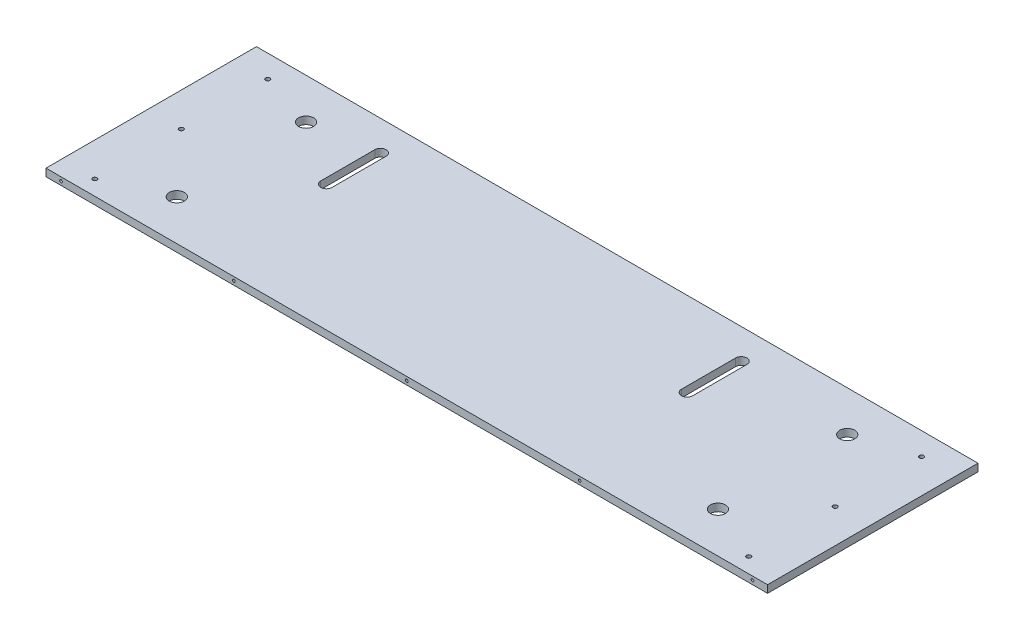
ISO-10303-21;
HEADER;
FILE_DESCRIPTION(('STEP AP214'),'2;1');
FILE_NAME('part.step','',(''),(''),'','','');
FILE_SCHEMA(('AUTOMOTIVE_DESIGN { 1 0 10303 214 1 1 1 1 }'));
ENDSEC;
DATA;
#1=APPLICATION_CONTEXT('core data for automotive mechanical design processes');
#2=APPLICATION_PROTOCOL_DEFINITION('international standard','automotive_design',2000,#1);
#3=PRODUCT_CONTEXT('',#1,'mechanical');
#4=PRODUCT('Part','Part','',(#3));
#5=PRODUCT_RELATED_PRODUCT_CATEGORY('part','',(#4));
#6=PRODUCT_DEFINITION_FORMATION('','',#4);
#7=PRODUCT_DEFINITION_CONTEXT('part definition',#1,'design');
#8=PRODUCT_DEFINITION('design','',#6,#7);
#9=PRODUCT_DEFINITION_SHAPE('','',#8);
#10=(LENGTH_UNIT() NAMED_UNIT(*) SI_UNIT(.MILLI.,.METRE.));
#11=(NAMED_UNIT(*) PLANE_ANGLE_UNIT() SI_UNIT($,.RADIAN.));
#12=(NAMED_UNIT(*) SI_UNIT($,.STERADIAN.) SOLID_ANGLE_UNIT());
#13=UNCERTAINTY_MEASURE_WITH_UNIT(LENGTH_MEASURE(1.E-05),#10,'distance_accuracy_value','');
#14=(GEOMETRIC_REPRESENTATION_CONTEXT(3) GLOBAL_UNCERTAINTY_ASSIGNED_CONTEXT((#13)) GLOBAL_UNIT_ASSIGNED_CONTEXT((#10,
#11,#12)) REPRESENTATION_CONTEXT('',''));
#15=CARTESIAN_POINT('',(0.,0.,0.));
#16=DIRECTION('',(0.,0.,1.));
#17=DIRECTION('',(1.,0.,0.));
#18=AXIS2_PLACEMENT_3D('',#15,#16,#17);
#19=CARTESIAN_POINT('',(304.8,6.35,-88.9));
#20=DIRECTION('',(-1.,0.,0.));
#21=DIRECTION('',(0.,0.,1.));
#22=AXIS2_PLACEMENT_3D('',#19,#20,#21);
#23=PLANE('',#22);
#24=DIRECTION('',(0.,0.,-1.));
#25=VECTOR('',#24,1.);
#26=CARTESIAN_POINT('',(304.8,0.,-88.9));
#27=LINE('',#26,#25);
#28=CARTESIAN_POINT('',(304.8,0.,88.9));
#29=VERTEX_POINT('',#28);
#30=CARTESIAN_POINT('',(304.8,0.,-88.9));
#31=VERTEX_POINT('',#30);
#32=EDGE_CURVE('E316',#29,#31,#27,.T.);
#33=ORIENTED_EDGE('',*,*,#32,.T.);
#34=DIRECTION('',(0.,-1.,0.));
#35=VECTOR('',#34,1.);
#36=CARTESIAN_POINT('',(304.8,6.35,-88.9));
#37=LINE('',#36,#35);
#38=CARTESIAN_POINT('',(304.8,6.35,-88.9));
#39=VERTEX_POINT('',#38);
#40=EDGE_CURVE('E11',#39,#31,#37,.T.);
#41=ORIENTED_EDGE('',*,*,#40,.F.);
#42=DIRECTION('',(0.,0.,-1.));
#43=VECTOR('',#42,1.);
#44=CARTESIAN_POINT('',(304.8,6.35,-88.9));
#45=LINE('',#44,#43);
#46=CARTESIAN_POINT('',(304.8,6.35,88.9));
#47=VERTEX_POINT('',#46);
#48=EDGE_CURVE('E317',#47,#39,#45,.T.);
#49=ORIENTED_EDGE('',*,*,#48,.F.);
#50=DIRECTION('',(0.,-1.,0.));
#51=VECTOR('',#50,1.);
#52=CARTESIAN_POINT('',(304.8,6.35,88.9));
#53=LINE('',#52,#51);
#54=EDGE_CURVE('E327',#47,#29,#53,.T.);
#55=ORIENTED_EDGE('',*,*,#54,.T.);
#56=EDGE_LOOP('',(#33,#41,#49,#55));
#57=FACE_BOUND('',#56,.T.);
#58=ADVANCED_FACE('F37',(#57),#23,.F.);
#59=CARTESIAN_POINT('',(-304.8,6.35,-88.9));
#60=DIRECTION('',(0.,0.,1.));
#61=DIRECTION('',(1.,0.,0.));
#62=AXIS2_PLACEMENT_3D('',#59,#60,#61);
#63=PLANE('',#62);
#64=DIRECTION('',(-1.,0.,0.));
#65=VECTOR('',#64,1.);
#66=CARTESIAN_POINT('',(-304.8,0.,-88.9));
#67=LINE('',#66,#65);
#68=CARTESIAN_POINT('',(-304.8,0.,-88.9));
#69=VERTEX_POINT('',#68);
#70=EDGE_CURVE('E330',#31,#69,#67,.T.);
#71=ORIENTED_EDGE('',*,*,#70,.T.);
#72=DIRECTION('',(0.,-1.,0.));
#73=VECTOR('',#72,1.);
#74=CARTESIAN_POINT('',(-304.8,6.35,-88.9));
#75=LINE('',#74,#73);
#76=CARTESIAN_POINT('',(-304.8,6.35,-88.9));
#77=VERTEX_POINT('',#76);
#78=EDGE_CURVE('E44',#77,#69,#75,.T.);
#79=ORIENTED_EDGE('',*,*,#78,.F.);
#80=DIRECTION('',(-1.,0.,0.));
#81=VECTOR('',#80,1.);
#82=CARTESIAN_POINT('',(-304.8,6.35,-88.9));
#83=LINE('',#82,#81);
#84=EDGE_CURVE('E320',#39,#77,#83,.T.);
#85=ORIENTED_EDGE('',*,*,#84,.F.);
#86=ORIENTED_EDGE('',*,*,#40,.T.);
#87=EDGE_LOOP('',(#71,#79,#85,#86));
#88=FACE_BOUND('',#87,.T.);
#89=ADVANCED_FACE('F359',(#88),#63,.F.);
#90=CARTESIAN_POINT('',(-304.8,6.35,-88.9));
#91=DIRECTION('',(1.,0.,0.));
#92=DIRECTION('',(0.,0.,-1.));
#93=AXIS2_PLACEMENT_3D('',#90,#91,#92);
#94=PLANE('',#93);
#95=DIRECTION('',(0.,0.,1.));
#96=VECTOR('',#95,1.);
#97=CARTESIAN_POINT('',(-304.8,0.,-88.9));
#98=LINE('',#97,#96);
#99=CARTESIAN_POINT('',(-304.8,0.,88.9));
#100=VERTEX_POINT('',#99);
#101=EDGE_CURVE('E332',#69,#100,#98,.T.);
#102=ORIENTED_EDGE('',*,*,#101,.T.);
#103=DIRECTION('',(0.,-1.,0.));
#104=VECTOR('',#103,1.);
#105=CARTESIAN_POINT('',(-304.8,6.35,88.9));
#106=LINE('',#105,#104);
#107=CARTESIAN_POINT('',(-304.8,6.35,88.9));
#108=VERTEX_POINT('',#107);
#109=EDGE_CURVE('E337',#108,#100,#106,.T.);
#110=ORIENTED_EDGE('',*,*,#109,.F.);
#111=DIRECTION('',(0.,0.,1.));
#112=VECTOR('',#111,1.);
#113=CARTESIAN_POINT('',(-304.8,6.35,-88.9));
#114=LINE('',#113,#112);
#115=EDGE_CURVE('E323',#77,#108,#114,.T.);
#116=ORIENTED_EDGE('',*,*,#115,.F.);
#117=ORIENTED_EDGE('',*,*,#78,.T.);
#118=EDGE_LOOP('',(#102,#110,#116,#117));
#119=FACE_BOUND('',#118,.T.);
#120=ADVANCED_FACE('F344',(#119),#94,.F.);
#121=CARTESIAN_POINT('',(-304.8,6.35,88.9));
#122=DIRECTION('',(0.,0.,-1.));
#123=DIRECTION('',(-1.,0.,0.));
#124=AXIS2_PLACEMENT_3D('',#121,#122,#123);
#125=PLANE('',#124);
#126=CARTESIAN_POINT('',(-292.1,3.17499999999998,88.9));
#127=DIRECTION('',(0.,0.,1.));
#128=DIRECTION('',(1.,0.,0.));
#129=AXIS2_PLACEMENT_3D('',#126,#127,#128);
#130=CIRCLE('',#129,1.13029999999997);
#131=CARTESIAN_POINT('',(-290.9697,3.17499999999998,88.9));
#132=VERTEX_POINT('',#131);
#133=EDGE_CURVE('E286',#132,#132,#130,.T.);
#134=ORIENTED_EDGE('',*,*,#133,.F.);
#135=EDGE_LOOP('',(#134));
#136=FACE_BOUND('',#135,.T.);
#137=CARTESIAN_POINT('',(-146.05,3.17499999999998,88.9));
#138=DIRECTION('',(0.,0.,1.));
#139=DIRECTION('',(1.,0.,0.));
#140=AXIS2_PLACEMENT_3D('',#137,#138,#139);
#141=CIRCLE('',#140,1.1303);
#142=CARTESIAN_POINT('',(-144.9197,3.17499999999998,88.9));
#143=VERTEX_POINT('',#142);
#144=EDGE_CURVE('E292',#143,#143,#141,.T.);
#145=ORIENTED_EDGE('',*,*,#144,.F.);
#146=EDGE_LOOP('',(#145));
#147=FACE_BOUND('',#146,.T.);
#148=CARTESIAN_POINT('',(0.,3.17499999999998,88.9));
#149=DIRECTION('',(0.,0.,1.));
#150=DIRECTION('',(1.,0.,0.));
#151=AXIS2_PLACEMENT_3D('',#148,#149,#150);
#152=CIRCLE('',#151,1.1303);
#153=CARTESIAN_POINT('',(1.1303,3.17499999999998,88.9));
#154=VERTEX_POINT('',#153);
#155=EDGE_CURVE('E298',#154,#154,#152,.T.);
#156=ORIENTED_EDGE('',*,*,#155,.F.);
#157=EDGE_LOOP('',(#156));
#158=FACE_BOUND('',#157,.T.);
#159=CARTESIAN_POINT('',(146.05,3.17499999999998,88.9));
#160=DIRECTION('',(0.,0.,1.));
#161=DIRECTION('',(1.,0.,0.));
#162=AXIS2_PLACEMENT_3D('',#159,#160,#161);
#163=CIRCLE('',#162,1.1303);
#164=CARTESIAN_POINT('',(147.1803,3.17499999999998,88.9));
#165=VERTEX_POINT('',#164);
#166=EDGE_CURVE('E304',#165,#165,#163,.T.);
#167=ORIENTED_EDGE('',*,*,#166,.F.);
#168=EDGE_LOOP('',(#167));
#169=FACE_BOUND('',#168,.T.);
#170=CARTESIAN_POINT('',(292.1,3.17499999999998,88.9));
#171=DIRECTION('',(0.,0.,1.));
#172=DIRECTION('',(1.,0.,0.));
#173=AXIS2_PLACEMENT_3D('',#170,#171,#172);
#174=CIRCLE('',#173,1.13029999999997);
#175=CARTESIAN_POINT('',(293.2303,3.17499999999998,88.9));
#176=VERTEX_POINT('',#175);
#177=EDGE_CURVE('E310',#176,#176,#174,.T.);
#178=ORIENTED_EDGE('',*,*,#177,.F.);
#179=EDGE_LOOP('',(#178));
#180=FACE_BOUND('',#179,.T.);
#181=DIRECTION('',(1.,0.,0.));
#182=VECTOR('',#181,1.);
#183=CARTESIAN_POINT('',(-304.8,0.,88.9));
#184=LINE('',#183,#182);
#185=EDGE_CURVE('E321',#100,#29,#184,.T.);
#186=ORIENTED_EDGE('',*,*,#185,.T.);
#187=ORIENTED_EDGE('',*,*,#54,.F.);
#188=DIRECTION('',(1.,0.,0.));
#189=VECTOR('',#188,1.);
#190=CARTESIAN_POINT('',(-304.8,6.35,88.9));
#191=LINE('',#190,#189);
#192=EDGE_CURVE('E325',#108,#47,#191,.T.);
#193=ORIENTED_EDGE('',*,*,#192,.F.);
#194=ORIENTED_EDGE('',*,*,#109,.T.);
#195=EDGE_LOOP('',(#186,#187,#193,#194));
#196=FACE_BOUND('',#195,.T.);
#197=ADVANCED_FACE('F353',(#136,#147,#158,#169,#180,#196),#125,.F.);
#198=CARTESIAN_POINT('',(0.,6.35,0.));
#199=DIRECTION('',(0.,1.,0.));
#200=DIRECTION('',(0.,0.,1.));
#201=AXIS2_PLACEMENT_3D('',#198,#199,#200);
#202=PLANE('',#201);
#203=CARTESIAN_POINT('',(130.175,6.35,-17.78));
#204=DIRECTION('',(0.,-1.,0.));
#205=DIRECTION('',(0.,0.,1.));
#206=AXIS2_PLACEMENT_3D('',#203,#204,#205);
#207=CIRCLE('',#206,4.7625);
#208=CARTESIAN_POINT('',(134.9375,6.35,-17.78));
#209=VERTEX_POINT('',#208);
#210=CARTESIAN_POINT('',(125.4125,6.35,-17.78));
#211=VERTEX_POINT('',#210);
#212=EDGE_CURVE('E142',#209,#211,#207,.T.);
#213=ORIENTED_EDGE('',*,*,#212,.T.);
#214=DIRECTION('',(0.,0.,-1.));
#215=VECTOR('',#214,1.);
#216=CARTESIAN_POINT('',(125.4125,6.35,-17.78));
#217=LINE('',#216,#215);
#218=CARTESIAN_POINT('',(125.4125,6.35,-63.5));
#219=VERTEX_POINT('',#218);
#220=EDGE_CURVE('E151',#211,#219,#217,.T.);
#221=ORIENTED_EDGE('',*,*,#220,.T.);
#222=CARTESIAN_POINT('',(130.175,6.35,-63.5));
#223=DIRECTION('',(0.,-1.,0.));
#224=DIRECTION('',(0.,0.,1.));
#225=AXIS2_PLACEMENT_3D('',#222,#223,#224);
#226=CIRCLE('',#225,4.7625);
#227=CARTESIAN_POINT('',(134.9375,6.35,-63.5));
#228=VERTEX_POINT('',#227);
#229=EDGE_CURVE('E51',#219,#228,#226,.T.);
#230=ORIENTED_EDGE('',*,*,#229,.T.);
#231=DIRECTION('',(0.,0.,1.));
#232=VECTOR('',#231,1.);
#233=CARTESIAN_POINT('',(134.9375,6.35,-17.78));
#234=LINE('',#233,#232);
#235=EDGE_CURVE('E148',#228,#209,#234,.T.);
#236=ORIENTED_EDGE('',*,*,#235,.T.);
#237=EDGE_LOOP('',(#213,#221,#230,#236));
#238=FACE_BOUND('',#237,.T.);
#239=CARTESIAN_POINT('',(-174.625,6.35,-17.78));
#240=DIRECTION('',(0.,-1.,0.));
#241=DIRECTION('',(0.,0.,1.));
#242=AXIS2_PLACEMENT_3D('',#239,#240,#241);
#243=CIRCLE('',#242,4.7625);
#244=CARTESIAN_POINT('',(-169.8625,6.35,-17.78));
#245=VERTEX_POINT('',#244);
#246=CARTESIAN_POINT('',(-179.3875,6.35,-17.78));
#247=VERTEX_POINT('',#246);
#248=EDGE_CURVE('E177',#245,#247,#243,.T.);
#249=ORIENTED_EDGE('',*,*,#248,.T.);
#250=DIRECTION('',(0.,0.,-1.));
#251=VECTOR('',#250,1.);
#252=CARTESIAN_POINT('',(-179.3875,6.35,-17.78));
#253=LINE('',#252,#251);
#254=CARTESIAN_POINT('',(-179.3875,6.35,-63.5));
#255=VERTEX_POINT('',#254);
#256=EDGE_CURVE('E180',#247,#255,#253,.T.);
#257=ORIENTED_EDGE('',*,*,#256,.T.);
#258=CARTESIAN_POINT('',(-174.625,6.35,-63.5));
#259=DIRECTION('',(0.,-1.,0.));
#260=DIRECTION('',(0.,0.,1.));
#261=AXIS2_PLACEMENT_3D('',#258,#259,#260);
#262=CIRCLE('',#261,4.7625);
#263=CARTESIAN_POINT('',(-169.8625,6.35,-63.5));
#264=VERTEX_POINT('',#263);
#265=EDGE_CURVE('E184',#255,#264,#262,.T.);
#266=ORIENTED_EDGE('',*,*,#265,.T.);
#267=DIRECTION('',(0.,0.,1.));
#268=VECTOR('',#267,1.);
#269=CARTESIAN_POINT('',(-169.8625,6.35,-17.78));
#270=LINE('',#269,#268);
#271=EDGE_CURVE('E187',#264,#245,#270,.T.);
#272=ORIENTED_EDGE('',*,*,#271,.T.);
#273=EDGE_LOOP('',(#249,#257,#266,#272));
#274=FACE_BOUND('',#273,.T.);
#275=CARTESIAN_POINT('',(-228.6,6.35,54.61));
#276=DIRECTION('',(0.,-1.,0.));
#277=DIRECTION('',(0.,0.,-1.));
#278=AXIS2_PLACEMENT_3D('',#275,#276,#277);
#279=CIRCLE('',#278,6.34999999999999);
#280=CARTESIAN_POINT('',(-228.6,6.35,48.26));
#281=VERTEX_POINT('',#280);
#282=EDGE_CURVE('E211',#281,#281,#279,.T.);
#283=ORIENTED_EDGE('',*,*,#282,.T.);
#284=EDGE_LOOP('',(#283));
#285=FACE_BOUND('',#284,.T.);
#286=CARTESIAN_POINT('',(-228.6,6.35,-54.61));
#287=DIRECTION('',(0.,-1.,0.));
#288=DIRECTION('',(0.,0.,-1.));
#289=AXIS2_PLACEMENT_3D('',#286,#287,#288);
#290=CIRCLE('',#289,6.34999999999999);
#291=CARTESIAN_POINT('',(-228.6,6.35,-60.96));
#292=VERTEX_POINT('',#291);
#293=EDGE_CURVE('E217',#292,#292,#290,.T.);
#294=ORIENTED_EDGE('',*,*,#293,.T.);
#295=EDGE_LOOP('',(#294));
#296=FACE_BOUND('',#295,.T.);
#297=CARTESIAN_POINT('',(228.6,6.35,-54.61));
#298=DIRECTION('',(0.,-1.,0.));
#299=DIRECTION('',(0.,0.,-1.));
#300=AXIS2_PLACEMENT_3D('',#297,#298,#299);
#301=CIRCLE('',#300,6.34999999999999);
#302=CARTESIAN_POINT('',(228.6,6.35,-60.96));
#303=VERTEX_POINT('',#302);
#304=EDGE_CURVE('E223',#303,#303,#301,.T.);
#305=ORIENTED_EDGE('',*,*,#304,.T.);
#306=EDGE_LOOP('',(#305));
#307=FACE_BOUND('',#306,.T.);
#308=CARTESIAN_POINT('',(228.6,6.35,54.61));
#309=DIRECTION('',(0.,-1.,0.));
#310=DIRECTION('',(0.,0.,-1.));
#311=AXIS2_PLACEMENT_3D('',#308,#309,#310);
#312=CIRCLE('',#311,6.34999999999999);
#313=CARTESIAN_POINT('',(228.6,6.35,48.26));
#314=VERTEX_POINT('',#313);
#315=EDGE_CURVE('E229',#314,#314,#312,.T.);
#316=ORIENTED_EDGE('',*,*,#315,.T.);
#317=EDGE_LOOP('',(#316));
#318=FACE_BOUND('',#317,.T.);
#319=CARTESIAN_POINT('',(-276.225,6.35,76.2));
#320=DIRECTION('',(0.,-1.,0.));
#321=DIRECTION('',(0.,0.,-1.));
#322=AXIS2_PLACEMENT_3D('',#319,#320,#321);
#323=CIRCLE('',#322,1.82880000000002);
#324=CARTESIAN_POINT('',(-276.225,6.35,74.3712));
#325=VERTEX_POINT('',#324);
#326=EDGE_CURVE('E238',#325,#325,#323,.T.);
#327=ORIENTED_EDGE('',*,*,#326,.T.);
#328=EDGE_LOOP('',(#327));
#329=FACE_BOUND('',#328,.T.);
#330=CARTESIAN_POINT('',(-276.225,6.35,3.17500000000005));
#331=DIRECTION('',(0.,-1.,0.));
#332=DIRECTION('',(0.,0.,-1.));
#333=AXIS2_PLACEMENT_3D('',#330,#331,#332);
#334=CIRCLE('',#333,1.82880000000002);
#335=CARTESIAN_POINT('',(-276.225,6.35,1.34620000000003));
#336=VERTEX_POINT('',#335);
#337=EDGE_CURVE('E247',#336,#336,#334,.T.);
#338=ORIENTED_EDGE('',*,*,#337,.T.);
#339=EDGE_LOOP('',(#338));
#340=FACE_BOUND('',#339,.T.);
#341=CARTESIAN_POINT('',(-276.225,6.35,-69.8499999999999));
#342=DIRECTION('',(0.,-1.,0.));
#343=DIRECTION('',(0.,0.,-1.));
#344=AXIS2_PLACEMENT_3D('',#341,#342,#343);
#345=CIRCLE('',#344,1.82880000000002);
#346=CARTESIAN_POINT('',(-276.225,6.35,-71.6788));
#347=VERTEX_POINT('',#346);
#348=EDGE_CURVE('E256',#347,#347,#345,.T.);
#349=ORIENTED_EDGE('',*,*,#348,.T.);
#350=EDGE_LOOP('',(#349));
#351=FACE_BOUND('',#350,.T.);
#352=CARTESIAN_POINT('',(276.225,6.35,-69.8499999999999));
#353=DIRECTION('',(0.,-1.,0.));
#354=DIRECTION('',(0.,0.,-1.));
#355=AXIS2_PLACEMENT_3D('',#352,#353,#354);
#356=CIRCLE('',#355,1.82880000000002);
#357=CARTESIAN_POINT('',(276.225,6.35,-71.6788));
#358=VERTEX_POINT('',#357);
#359=EDGE_CURVE('E265',#358,#358,#356,.T.);
#360=ORIENTED_EDGE('',*,*,#359,.T.);
#361=EDGE_LOOP('',(#360));
#362=FACE_BOUND('',#361,.T.);
#363=CARTESIAN_POINT('',(276.225,6.35,3.17500000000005));
#364=DIRECTION('',(0.,-1.,0.));
#365=DIRECTION('',(0.,0.,-1.));
#366=AXIS2_PLACEMENT_3D('',#363,#364,#365);
#367=CIRCLE('',#366,1.82880000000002);
#368=CARTESIAN_POINT('',(276.225,6.35,1.34620000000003));
#369=VERTEX_POINT('',#368);
#370=EDGE_CURVE('E274',#369,#369,#367,.T.);
#371=ORIENTED_EDGE('',*,*,#370,.T.);
#372=EDGE_LOOP('',(#371));
#373=FACE_BOUND('',#372,.T.);
#374=CARTESIAN_POINT('',(276.225,6.35,76.2));
#375=DIRECTION('',(0.,-1.,0.));
#376=DIRECTION('',(0.,0.,-1.));
#377=AXIS2_PLACEMENT_3D('',#374,#375,#376);
#378=CIRCLE('',#377,1.82880000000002);
#379=CARTESIAN_POINT('',(276.225,6.35,74.3712));
#380=VERTEX_POINT('',#379);
#381=EDGE_CURVE('E283',#380,#380,#378,.T.);
#382=ORIENTED_EDGE('',*,*,#381,.T.);
#383=EDGE_LOOP('',(#382));
#384=FACE_BOUND('',#383,.T.);
#385=ORIENTED_EDGE('',*,*,#48,.T.);
#386=ORIENTED_EDGE('',*,*,#84,.T.);
#387=ORIENTED_EDGE('',*,*,#115,.T.);
#388=ORIENTED_EDGE('',*,*,#192,.T.);
#389=EDGE_LOOP('',(#385,#386,#387,#388));
#390=FACE_BOUND('',#389,.T.);
#391=ADVANCED_FACE('F155',(#238,#274,#285,#296,#307,#318,#329,#340,#351,#362,#373,#384,#390),
#202,.T.);
#392=CARTESIAN_POINT('',(0.,0.,0.));
#393=DIRECTION('',(0.,1.,0.));
#394=DIRECTION('',(0.,0.,1.));
#395=AXIS2_PLACEMENT_3D('',#392,#393,#394);
#396=PLANE('',#395);
#397=DIRECTION('',(0.,0.,-1.));
#398=VECTOR('',#397,1.);
#399=CARTESIAN_POINT('',(125.4125,0.,-17.78));
#400=LINE('',#399,#398);
#401=CARTESIAN_POINT('',(125.4125,0.,-17.78));
#402=VERTEX_POINT('',#401);
#403=CARTESIAN_POINT('',(125.4125,0.,-63.5));
#404=VERTEX_POINT('',#403);
#405=EDGE_CURVE('E167',#402,#404,#400,.T.);
#406=ORIENTED_EDGE('',*,*,#405,.F.);
#407=CARTESIAN_POINT('',(130.175,0.,-17.78));
#408=DIRECTION('',(0.,-1.,0.));
#409=DIRECTION('',(0.,0.,1.));
#410=AXIS2_PLACEMENT_3D('',#407,#408,#409);
#411=CIRCLE('',#410,4.7625);
#412=CARTESIAN_POINT('',(134.9375,0.,-17.78));
#413=VERTEX_POINT('',#412);
#414=EDGE_CURVE('E59',#413,#402,#411,.T.);
#415=ORIENTED_EDGE('',*,*,#414,.F.);
#416=DIRECTION('',(0.,0.,1.));
#417=VECTOR('',#416,1.);
#418=CARTESIAN_POINT('',(134.9375,0.,-17.78));
#419=LINE('',#418,#417);
#420=CARTESIAN_POINT('',(134.9375,0.,-63.5));
#421=VERTEX_POINT('',#420);
#422=EDGE_CURVE('E158',#421,#413,#419,.T.);
#423=ORIENTED_EDGE('',*,*,#422,.F.);
#424=CARTESIAN_POINT('',(130.175,0.,-63.5));
#425=DIRECTION('',(0.,-1.,0.));
#426=DIRECTION('',(0.,0.,1.));
#427=AXIS2_PLACEMENT_3D('',#424,#425,#426);
#428=CIRCLE('',#427,4.7625);
#429=EDGE_CURVE('E161',#404,#421,#428,.T.);
#430=ORIENTED_EDGE('',*,*,#429,.F.);
#431=EDGE_LOOP('',(#406,#415,#423,#430));
#432=FACE_BOUND('',#431,.T.);
#433=DIRECTION('',(0.,0.,-1.));
#434=VECTOR('',#433,1.);
#435=CARTESIAN_POINT('',(-179.3875,0.,-17.78));
#436=LINE('',#435,#434);
#437=CARTESIAN_POINT('',(-179.3875,0.,-17.78));
#438=VERTEX_POINT('',#437);
#439=CARTESIAN_POINT('',(-179.3875,0.,-63.5));
#440=VERTEX_POINT('',#439);
#441=EDGE_CURVE('E192',#438,#440,#436,.T.);
#442=ORIENTED_EDGE('',*,*,#441,.F.);
#443=CARTESIAN_POINT('',(-174.625,0.,-17.78));
#444=DIRECTION('',(0.,-1.,0.));
#445=DIRECTION('',(0.,0.,1.));
#446=AXIS2_PLACEMENT_3D('',#443,#444,#445);
#447=CIRCLE('',#446,4.7625);
#448=CARTESIAN_POINT('',(-169.8625,0.,-17.78));
#449=VERTEX_POINT('',#448);
#450=EDGE_CURVE('E173',#449,#438,#447,.T.);
#451=ORIENTED_EDGE('',*,*,#450,.F.);
#452=DIRECTION('',(0.,0.,1.));
#453=VECTOR('',#452,1.);
#454=CARTESIAN_POINT('',(-169.8625,0.,-17.78));
#455=LINE('',#454,#453);
#456=CARTESIAN_POINT('',(-169.8625,0.,-63.5));
#457=VERTEX_POINT('',#456);
#458=EDGE_CURVE('E181',#457,#449,#455,.T.);
#459=ORIENTED_EDGE('',*,*,#458,.F.);
#460=CARTESIAN_POINT('',(-174.625,0.,-63.5));
#461=DIRECTION('',(0.,-1.,0.));
#462=DIRECTION('',(0.,0.,1.));
#463=AXIS2_PLACEMENT_3D('',#460,#461,#462);
#464=CIRCLE('',#463,4.7625);
#465=EDGE_CURVE('E195',#440,#457,#464,.T.);
#466=ORIENTED_EDGE('',*,*,#465,.F.);
#467=EDGE_LOOP('',(#442,#451,#459,#466));
#468=FACE_BOUND('',#467,.T.);
#469=CARTESIAN_POINT('',(-228.6,0.,54.61));
#470=DIRECTION('',(0.,-1.,0.));
#471=DIRECTION('',(0.,0.,-1.));
#472=AXIS2_PLACEMENT_3D('',#469,#470,#471);
#473=CIRCLE('',#472,6.34999999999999);
#474=CARTESIAN_POINT('',(-228.6,0.,48.26));
#475=VERTEX_POINT('',#474);
#476=EDGE_CURVE('E202',#475,#475,#473,.T.);
#477=ORIENTED_EDGE('',*,*,#476,.F.);
#478=EDGE_LOOP('',(#477));
#479=FACE_BOUND('',#478,.T.);
#480=CARTESIAN_POINT('',(-228.6,0.,-54.61));
#481=DIRECTION('',(0.,-1.,0.));
#482=DIRECTION('',(0.,0.,-1.));
#483=AXIS2_PLACEMENT_3D('',#480,#481,#482);
#484=CIRCLE('',#483,6.34999999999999);
#485=CARTESIAN_POINT('',(-228.6,0.,-60.96));
#486=VERTEX_POINT('',#485);
#487=EDGE_CURVE('E214',#486,#486,#484,.T.);
#488=ORIENTED_EDGE('',*,*,#487,.F.);
#489=EDGE_LOOP('',(#488));
#490=FACE_BOUND('',#489,.T.);
#491=CARTESIAN_POINT('',(228.6,0.,-54.61));
#492=DIRECTION('',(0.,-1.,0.));
#493=DIRECTION('',(0.,0.,-1.));
#494=AXIS2_PLACEMENT_3D('',#491,#492,#493);
#495=CIRCLE('',#494,6.34999999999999);
#496=CARTESIAN_POINT('',(228.6,0.,-60.96));
#497=VERTEX_POINT('',#496);
#498=EDGE_CURVE('E220',#497,#497,#495,.T.);
#499=ORIENTED_EDGE('',*,*,#498,.F.);
#500=EDGE_LOOP('',(#499));
#501=FACE_BOUND('',#500,.T.);
#502=CARTESIAN_POINT('',(228.6,0.,54.61));
#503=DIRECTION('',(0.,-1.,0.));
#504=DIRECTION('',(0.,0.,-1.));
#505=AXIS2_PLACEMENT_3D('',#502,#503,#504);
#506=CIRCLE('',#505,6.34999999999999);
#507=CARTESIAN_POINT('',(228.6,0.,48.26));
#508=VERTEX_POINT('',#507);
#509=EDGE_CURVE('E226',#508,#508,#506,.T.);
#510=ORIENTED_EDGE('',*,*,#509,.F.);
#511=EDGE_LOOP('',(#510));
#512=FACE_BOUND('',#511,.T.);
#513=CARTESIAN_POINT('',(-276.225,0.,76.2));
#514=DIRECTION('',(0.,-1.,0.));
#515=DIRECTION('',(0.,0.,-1.));
#516=AXIS2_PLACEMENT_3D('',#513,#514,#515);
#517=CIRCLE('',#516,3.54330000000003);
#518=CARTESIAN_POINT('',(-276.225,0.,72.6567));
#519=VERTEX_POINT('',#518);
#520=EDGE_CURVE('E232',#519,#519,#517,.T.);
#521=ORIENTED_EDGE('',*,*,#520,.F.);
#522=EDGE_LOOP('',(#521));
#523=FACE_BOUND('',#522,.T.);
#524=CARTESIAN_POINT('',(-276.225,0.,3.17500000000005));
#525=DIRECTION('',(0.,-1.,0.));
#526=DIRECTION('',(0.,0.,-1.));
#527=AXIS2_PLACEMENT_3D('',#524,#525,#526);
#528=CIRCLE('',#527,3.54330000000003);
#529=CARTESIAN_POINT('',(-276.225,0.,-0.368299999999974));
#530=VERTEX_POINT('',#529);
#531=EDGE_CURVE('E241',#530,#530,#528,.T.);
#532=ORIENTED_EDGE('',*,*,#531,.F.);
#533=EDGE_LOOP('',(#532));
#534=FACE_BOUND('',#533,.T.);
#535=CARTESIAN_POINT('',(-276.225,0.,-69.8499999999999));
#536=DIRECTION('',(0.,-1.,0.));
#537=DIRECTION('',(0.,0.,-1.));
#538=AXIS2_PLACEMENT_3D('',#535,#536,#537);
#539=CIRCLE('',#538,3.54330000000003);
#540=CARTESIAN_POINT('',(-276.225,0.,-73.3933));
#541=VERTEX_POINT('',#540);
#542=EDGE_CURVE('E250',#541,#541,#539,.T.);
#543=ORIENTED_EDGE('',*,*,#542,.F.);
#544=EDGE_LOOP('',(#543));
#545=FACE_BOUND('',#544,.T.);
#546=CARTESIAN_POINT('',(276.225,0.,-69.8499999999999));
#547=DIRECTION('',(0.,-1.,0.));
#548=DIRECTION('',(0.,0.,-1.));
#549=AXIS2_PLACEMENT_3D('',#546,#547,#548);
#550=CIRCLE('',#549,3.54330000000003);
#551=CARTESIAN_POINT('',(276.225,0.,-73.3933));
#552=VERTEX_POINT('',#551);
#553=EDGE_CURVE('E259',#552,#552,#550,.T.);
#554=ORIENTED_EDGE('',*,*,#553,.F.);
#555=EDGE_LOOP('',(#554));
#556=FACE_BOUND('',#555,.T.);
#557=CARTESIAN_POINT('',(276.225,0.,3.17500000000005));
#558=DIRECTION('',(0.,-1.,0.));
#559=DIRECTION('',(0.,0.,-1.));
#560=AXIS2_PLACEMENT_3D('',#557,#558,#559);
#561=CIRCLE('',#560,3.54330000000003);
#562=CARTESIAN_POINT('',(276.225,0.,-0.368299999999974));
#563=VERTEX_POINT('',#562);
#564=EDGE_CURVE('E268',#563,#563,#561,.T.);
#565=ORIENTED_EDGE('',*,*,#564,.F.);
#566=EDGE_LOOP('',(#565));
#567=FACE_BOUND('',#566,.T.);
#568=CARTESIAN_POINT('',(276.225,0.,76.2));
#569=DIRECTION('',(0.,-1.,0.));
#570=DIRECTION('',(0.,0.,-1.));
#571=AXIS2_PLACEMENT_3D('',#568,#569,#570);
#572=CIRCLE('',#571,3.54330000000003);
#573=CARTESIAN_POINT('',(276.225,0.,72.6567));
#574=VERTEX_POINT('',#573);
#575=EDGE_CURVE('E277',#574,#574,#572,.T.);
#576=ORIENTED_EDGE('',*,*,#575,.F.);
#577=EDGE_LOOP('',(#576));
#578=FACE_BOUND('',#577,.T.);
#579=ORIENTED_EDGE('',*,*,#32,.F.);
#580=ORIENTED_EDGE('',*,*,#185,.F.);
#581=ORIENTED_EDGE('',*,*,#101,.F.);
#582=ORIENTED_EDGE('',*,*,#70,.F.);
#583=EDGE_LOOP('',(#579,#580,#581,#582));
#584=FACE_BOUND('',#583,.T.);
#585=ADVANCED_FACE('F350',(#432,#468,#479,#490,#501,#512,#523,#534,#545,#556,#567,#578,#584),
#396,.F.);
#586=CARTESIAN_POINT('',(292.1,3.17499999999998,81.3054));
#587=DIRECTION('',(0.,0.,1.));
#588=DIRECTION('',(1.,0.,0.));
#589=AXIS2_PLACEMENT_3D('',#586,#587,#588);
#590=CONICAL_SURFACE('',#589,1.13029999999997,1.02974425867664);
#591=CARTESIAN_POINT('',(292.1,3.17499999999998,80.6262472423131));
#592=VERTEX_POINT('',#591);
#593=VERTEX_LOOP('',#592);
#594=FACE_BOUND('',#593,.T.);
#595=CARTESIAN_POINT('',(292.1,3.17499999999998,81.3054));
#596=DIRECTION('',(0.,0.,1.));
#597=DIRECTION('',(1.,0.,0.));
#598=AXIS2_PLACEMENT_3D('',#595,#596,#597);
#599=CIRCLE('',#598,1.13029999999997);
#600=CARTESIAN_POINT('',(293.2303,3.17499999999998,81.3054));
#601=VERTEX_POINT('',#600);
#602=EDGE_CURVE('E313',#601,#601,#599,.T.);
#603=ORIENTED_EDGE('',*,*,#602,.T.);
#604=EDGE_LOOP('',(#603));
#605=FACE_BOUND('',#604,.T.);
#606=ADVANCED_FACE('F372',(#594,#605),#590,.F.);
#607=CARTESIAN_POINT('',(292.1,3.17499999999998,88.9));
#608=DIRECTION('',(0.,0.,1.));
#609=DIRECTION('',(1.,0.,0.));
#610=AXIS2_PLACEMENT_3D('',#607,#608,#609);
#611=CYLINDRICAL_SURFACE('',#610,1.13029999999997);
#612=ORIENTED_EDGE('',*,*,#602,.F.);
#613=EDGE_LOOP('',(#612));
#614=FACE_BOUND('',#613,.T.);
#615=ORIENTED_EDGE('',*,*,#177,.T.);
#616=EDGE_LOOP('',(#615));
#617=FACE_BOUND('',#616,.T.);
#618=ADVANCED_FACE('F378',(#614,#617),#611,.F.);
#619=CARTESIAN_POINT('',(146.05,3.17499999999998,81.3054));
#620=DIRECTION('',(0.,0.,1.));
#621=DIRECTION('',(1.,0.,0.));
#622=AXIS2_PLACEMENT_3D('',#619,#620,#621);
#623=CONICAL_SURFACE('',#622,1.1303,1.02974425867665);
#624=CARTESIAN_POINT('',(146.05,3.17499999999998,80.6262472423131));
#625=VERTEX_POINT('',#624);
#626=VERTEX_LOOP('',#625);
#627=FACE_BOUND('',#626,.T.);
#628=CARTESIAN_POINT('',(146.05,3.17499999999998,81.3054));
#629=DIRECTION('',(0.,0.,1.));
#630=DIRECTION('',(1.,0.,0.));
#631=AXIS2_PLACEMENT_3D('',#628,#629,#630);
#632=CIRCLE('',#631,1.1303);
#633=CARTESIAN_POINT('',(147.1803,3.17499999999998,81.3054));
#634=VERTEX_POINT('',#633);
#635=EDGE_CURVE('E307',#634,#634,#632,.T.);
#636=ORIENTED_EDGE('',*,*,#635,.T.);
#637=EDGE_LOOP('',(#636));
#638=FACE_BOUND('',#637,.T.);
#639=ADVANCED_FACE('F382',(#627,#638),#623,.F.);
#640=CARTESIAN_POINT('',(146.05,3.17499999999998,88.9));
#641=DIRECTION('',(0.,0.,1.));
#642=DIRECTION('',(1.,0.,0.));
#643=AXIS2_PLACEMENT_3D('',#640,#641,#642);
#644=CYLINDRICAL_SURFACE('',#643,1.1303);
#645=ORIENTED_EDGE('',*,*,#635,.F.);
#646=EDGE_LOOP('',(#645));
#647=FACE_BOUND('',#646,.T.);
#648=ORIENTED_EDGE('',*,*,#166,.T.);
#649=EDGE_LOOP('',(#648));
#650=FACE_BOUND('',#649,.T.);
#651=ADVANCED_FACE('F386',(#647,#650),#644,.F.);
#652=CARTESIAN_POINT('',(0.,3.17499999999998,81.3054));
#653=DIRECTION('',(0.,0.,1.));
#654=DIRECTION('',(1.,0.,0.));
#655=AXIS2_PLACEMENT_3D('',#652,#653,#654);
#656=CONICAL_SURFACE('',#655,1.1303,1.02974425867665);
#657=CARTESIAN_POINT('',(0.,3.17499999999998,80.6262472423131));
#658=VERTEX_POINT('',#657);
#659=VERTEX_LOOP('',#658);
#660=FACE_BOUND('',#659,.T.);
#661=CARTESIAN_POINT('',(0.,3.17499999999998,81.3054));
#662=DIRECTION('',(0.,0.,1.));
#663=DIRECTION('',(1.,0.,0.));
#664=AXIS2_PLACEMENT_3D('',#661,#662,#663);
#665=CIRCLE('',#664,1.1303);
#666=CARTESIAN_POINT('',(1.1303,3.17499999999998,81.3054));
#667=VERTEX_POINT('',#666);
#668=EDGE_CURVE('E301',#667,#667,#665,.T.);
#669=ORIENTED_EDGE('',*,*,#668,.T.);
#670=EDGE_LOOP('',(#669));
#671=FACE_BOUND('',#670,.T.);
#672=ADVANCED_FACE('F390',(#660,#671),#656,.F.);
#673=CARTESIAN_POINT('',(0.,3.17499999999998,88.9));
#674=DIRECTION('',(0.,0.,1.));
#675=DIRECTION('',(1.,0.,0.));
#676=AXIS2_PLACEMENT_3D('',#673,#674,#675);
#677=CYLINDRICAL_SURFACE('',#676,1.1303);
#678=ORIENTED_EDGE('',*,*,#668,.F.);
#679=EDGE_LOOP('',(#678));
#680=FACE_BOUND('',#679,.T.);
#681=ORIENTED_EDGE('',*,*,#155,.T.);
#682=EDGE_LOOP('',(#681));
#683=FACE_BOUND('',#682,.T.);
#684=ADVANCED_FACE('F394',(#680,#683),#677,.F.);
#685=CARTESIAN_POINT('',(-146.05,3.17499999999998,81.3054));
#686=DIRECTION('',(0.,0.,1.));
#687=DIRECTION('',(1.,0.,0.));
#688=AXIS2_PLACEMENT_3D('',#685,#686,#687);
#689=CONICAL_SURFACE('',#688,1.1303,1.02974425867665);
#690=CARTESIAN_POINT('',(-146.05,3.17499999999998,80.6262472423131));
#691=VERTEX_POINT('',#690);
#692=VERTEX_LOOP('',#691);
#693=FACE_BOUND('',#692,.T.);
#694=CARTESIAN_POINT('',(-146.05,3.17499999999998,81.3054));
#695=DIRECTION('',(0.,0.,1.));
#696=DIRECTION('',(1.,0.,0.));
#697=AXIS2_PLACEMENT_3D('',#694,#695,#696);
#698=CIRCLE('',#697,1.1303);
#699=CARTESIAN_POINT('',(-144.9197,3.17499999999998,81.3054));
#700=VERTEX_POINT('',#699);
#701=EDGE_CURVE('E295',#700,#700,#698,.T.);
#702=ORIENTED_EDGE('',*,*,#701,.T.);
#703=EDGE_LOOP('',(#702));
#704=FACE_BOUND('',#703,.T.);
#705=ADVANCED_FACE('F398',(#693,#704),#689,.F.);
#706=CARTESIAN_POINT('',(-146.05,3.17499999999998,88.9));
#707=DIRECTION('',(0.,0.,1.));
#708=DIRECTION('',(1.,0.,0.));
#709=AXIS2_PLACEMENT_3D('',#706,#707,#708);
#710=CYLINDRICAL_SURFACE('',#709,1.1303);
#711=ORIENTED_EDGE('',*,*,#701,.F.);
#712=EDGE_LOOP('',(#711));
#713=FACE_BOUND('',#712,.T.);
#714=ORIENTED_EDGE('',*,*,#144,.T.);
#715=EDGE_LOOP('',(#714));
#716=FACE_BOUND('',#715,.T.);
#717=ADVANCED_FACE('F402',(#713,#716),#710,.F.);
#718=CARTESIAN_POINT('',(-292.1,3.17499999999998,81.3054));
#719=DIRECTION('',(0.,0.,1.));
#720=DIRECTION('',(1.,0.,0.));
#721=AXIS2_PLACEMENT_3D('',#718,#719,#720);
#722=CONICAL_SURFACE('',#721,1.13029999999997,1.02974425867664);
#723=CARTESIAN_POINT('',(-292.1,3.17499999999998,80.6262472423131));
#724=VERTEX_POINT('',#723);
#725=VERTEX_LOOP('',#724);
#726=FACE_BOUND('',#725,.T.);
#727=CARTESIAN_POINT('',(-292.1,3.17499999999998,81.3054));
#728=DIRECTION('',(0.,0.,1.));
#729=DIRECTION('',(1.,0.,0.));
#730=AXIS2_PLACEMENT_3D('',#727,#728,#729);
#731=CIRCLE('',#730,1.13029999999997);
#732=CARTESIAN_POINT('',(-290.9697,3.17499999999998,81.3054));
#733=VERTEX_POINT('',#732);
#734=EDGE_CURVE('E289',#733,#733,#731,.T.);
#735=ORIENTED_EDGE('',*,*,#734,.T.);
#736=EDGE_LOOP('',(#735));
#737=FACE_BOUND('',#736,.T.);
#738=ADVANCED_FACE('F406',(#726,#737),#722,.F.);
#739=CARTESIAN_POINT('',(-292.1,3.17499999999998,88.9));
#740=DIRECTION('',(0.,0.,1.));
#741=DIRECTION('',(1.,0.,0.));
#742=AXIS2_PLACEMENT_3D('',#739,#740,#741);
#743=CYLINDRICAL_SURFACE('',#742,1.13029999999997);
#744=ORIENTED_EDGE('',*,*,#734,.F.);
#745=EDGE_LOOP('',(#744));
#746=FACE_BOUND('',#745,.T.);
#747=ORIENTED_EDGE('',*,*,#133,.T.);
#748=EDGE_LOOP('',(#747));
#749=FACE_BOUND('',#748,.T.);
#750=ADVANCED_FACE('F410',(#746,#749),#743,.F.);
#751=CARTESIAN_POINT('',(276.225,0.,76.2));
#752=DIRECTION('',(0.,-1.,0.));
#753=DIRECTION('',(0.,0.,-1.));
#754=AXIS2_PLACEMENT_3D('',#751,#752,#753);
#755=CYLINDRICAL_SURFACE('',#754,1.82880000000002);
#756=ORIENTED_EDGE('',*,*,#381,.F.);
#757=EDGE_LOOP('',(#756));
#758=FACE_BOUND('',#757,.T.);
#759=CARTESIAN_POINT('',(276.225,1.97230663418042,76.2));
#760=DIRECTION('',(0.,-1.,0.));
#761=DIRECTION('',(0.,0.,-1.));
#762=AXIS2_PLACEMENT_3D('',#759,#760,#761);
#763=CIRCLE('',#762,1.82880000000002);
#764=CARTESIAN_POINT('',(276.225,1.97230663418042,74.3712));
#765=VERTEX_POINT('',#764);
#766=EDGE_CURVE('E280',#765,#765,#763,.T.);
#767=ORIENTED_EDGE('',*,*,#766,.T.);
#768=EDGE_LOOP('',(#767));
#769=FACE_BOUND('',#768,.T.);
#770=ADVANCED_FACE('F414',(#758,#769),#755,.F.);
#771=CARTESIAN_POINT('',(276.225,0.,76.2));
#772=DIRECTION('',(0.,-1.,0.));
#773=DIRECTION('',(0.,0.,-1.));
#774=AXIS2_PLACEMENT_3D('',#771,#772,#773);
#775=CONICAL_SURFACE('',#774,3.54330000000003,0.715584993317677);
#776=ORIENTED_EDGE('',*,*,#766,.F.);
#777=EDGE_LOOP('',(#776));
#778=FACE_BOUND('',#777,.T.);
#779=ORIENTED_EDGE('',*,*,#575,.T.);
#780=EDGE_LOOP('',(#779));
#781=FACE_BOUND('',#780,.T.);
#782=ADVANCED_FACE('F418',(#778,#781),#775,.F.);
#783=CARTESIAN_POINT('',(276.225,0.,3.17500000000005));
#784=DIRECTION('',(0.,-1.,0.));
#785=DIRECTION('',(0.,0.,-1.));
#786=AXIS2_PLACEMENT_3D('',#783,#784,#785);
#787=CYLINDRICAL_SURFACE('',#786,1.82880000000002);
#788=ORIENTED_EDGE('',*,*,#370,.F.);
#789=EDGE_LOOP('',(#788));
#790=FACE_BOUND('',#789,.T.);
#791=CARTESIAN_POINT('',(276.225,1.97230663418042,3.17500000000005));
#792=DIRECTION('',(0.,-1.,0.));
#793=DIRECTION('',(0.,0.,-1.));
#794=AXIS2_PLACEMENT_3D('',#791,#792,#793);
#795=CIRCLE('',#794,1.82880000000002);
#796=CARTESIAN_POINT('',(276.225,1.97230663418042,1.34620000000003));
#797=VERTEX_POINT('',#796);
#798=EDGE_CURVE('E271',#797,#797,#795,.T.);
#799=ORIENTED_EDGE('',*,*,#798,.T.);
#800=EDGE_LOOP('',(#799));
#801=FACE_BOUND('',#800,.T.);
#802=ADVANCED_FACE('F422',(#790,#801),#787,.F.);
#803=CARTESIAN_POINT('',(276.225,0.,3.17500000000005));
#804=DIRECTION('',(0.,-1.,0.));
#805=DIRECTION('',(0.,0.,-1.));
#806=AXIS2_PLACEMENT_3D('',#803,#804,#805);
#807=CONICAL_SURFACE('',#806,3.54330000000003,0.715584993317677);
#808=ORIENTED_EDGE('',*,*,#798,.F.);
#809=EDGE_LOOP('',(#808));
#810=FACE_BOUND('',#809,.T.);
#811=ORIENTED_EDGE('',*,*,#564,.T.);
#812=EDGE_LOOP('',(#811));
#813=FACE_BOUND('',#812,.T.);
#814=ADVANCED_FACE('F426',(#810,#813),#807,.F.);
#815=CARTESIAN_POINT('',(276.225,0.,-69.8499999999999));
#816=DIRECTION('',(0.,-1.,0.));
#817=DIRECTION('',(0.,0.,-1.));
#818=AXIS2_PLACEMENT_3D('',#815,#816,#817);
#819=CYLINDRICAL_SURFACE('',#818,1.82880000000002);
#820=ORIENTED_EDGE('',*,*,#359,.F.);
#821=EDGE_LOOP('',(#820));
#822=FACE_BOUND('',#821,.T.);
#823=CARTESIAN_POINT('',(276.225,1.97230663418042,-69.8499999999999));
#824=DIRECTION('',(0.,-1.,0.));
#825=DIRECTION('',(0.,0.,-1.));
#826=AXIS2_PLACEMENT_3D('',#823,#824,#825);
#827=CIRCLE('',#826,1.82880000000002);
#828=CARTESIAN_POINT('',(276.225,1.97230663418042,-71.6788));
#829=VERTEX_POINT('',#828);
#830=EDGE_CURVE('E262',#829,#829,#827,.T.);
#831=ORIENTED_EDGE('',*,*,#830,.T.);
#832=EDGE_LOOP('',(#831));
#833=FACE_BOUND('',#832,.T.);
#834=ADVANCED_FACE('F430',(#822,#833),#819,.F.);
#835=CARTESIAN_POINT('',(276.225,0.,-69.8499999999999));
#836=DIRECTION('',(0.,-1.,0.));
#837=DIRECTION('',(0.,0.,-1.));
#838=AXIS2_PLACEMENT_3D('',#835,#836,#837);
#839=CONICAL_SURFACE('',#838,3.54330000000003,0.715584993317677);
#840=ORIENTED_EDGE('',*,*,#830,.F.);
#841=EDGE_LOOP('',(#840));
#842=FACE_BOUND('',#841,.T.);
#843=ORIENTED_EDGE('',*,*,#553,.T.);
#844=EDGE_LOOP('',(#843));
#845=FACE_BOUND('',#844,.T.);
#846=ADVANCED_FACE('F434',(#842,#845),#839,.F.);
#847=CARTESIAN_POINT('',(-276.225,0.,-69.8499999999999));
#848=DIRECTION('',(0.,-1.,0.));
#849=DIRECTION('',(0.,0.,-1.));
#850=AXIS2_PLACEMENT_3D('',#847,#848,#849);
#851=CYLINDRICAL_SURFACE('',#850,1.82880000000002);
#852=ORIENTED_EDGE('',*,*,#348,.F.);
#853=EDGE_LOOP('',(#852));
#854=FACE_BOUND('',#853,.T.);
#855=CARTESIAN_POINT('',(-276.225,1.97230663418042,-69.8499999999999));
#856=DIRECTION('',(0.,-1.,0.));
#857=DIRECTION('',(0.,0.,-1.));
#858=AXIS2_PLACEMENT_3D('',#855,#856,#857);
#859=CIRCLE('',#858,1.82880000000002);
#860=CARTESIAN_POINT('',(-276.225,1.97230663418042,-71.6788));
#861=VERTEX_POINT('',#860);
#862=EDGE_CURVE('E253',#861,#861,#859,.T.);
#863=ORIENTED_EDGE('',*,*,#862,.T.);
#864=EDGE_LOOP('',(#863));
#865=FACE_BOUND('',#864,.T.);
#866=ADVANCED_FACE('F438',(#854,#865),#851,.F.);
#867=CARTESIAN_POINT('',(-276.225,0.,-69.8499999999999));
#868=DIRECTION('',(0.,-1.,0.));
#869=DIRECTION('',(0.,0.,-1.));
#870=AXIS2_PLACEMENT_3D('',#867,#868,#869);
#871=CONICAL_SURFACE('',#870,3.54330000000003,0.715584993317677);
#872=ORIENTED_EDGE('',*,*,#862,.F.);
#873=EDGE_LOOP('',(#872));
#874=FACE_BOUND('',#873,.T.);
#875=ORIENTED_EDGE('',*,*,#542,.T.);
#876=EDGE_LOOP('',(#875));
#877=FACE_BOUND('',#876,.T.);
#878=ADVANCED_FACE('F442',(#874,#877),#871,.F.);
#879=CARTESIAN_POINT('',(-276.225,0.,3.17500000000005));
#880=DIRECTION('',(0.,-1.,0.));
#881=DIRECTION('',(0.,0.,-1.));
#882=AXIS2_PLACEMENT_3D('',#879,#880,#881);
#883=CYLINDRICAL_SURFACE('',#882,1.82880000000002);
#884=ORIENTED_EDGE('',*,*,#337,.F.);
#885=EDGE_LOOP('',(#884));
#886=FACE_BOUND('',#885,.T.);
#887=CARTESIAN_POINT('',(-276.225,1.97230663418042,3.17500000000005));
#888=DIRECTION('',(0.,-1.,0.));
#889=DIRECTION('',(0.,0.,-1.));
#890=AXIS2_PLACEMENT_3D('',#887,#888,#889);
#891=CIRCLE('',#890,1.82880000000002);
#892=CARTESIAN_POINT('',(-276.225,1.97230663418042,1.34620000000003));
#893=VERTEX_POINT('',#892);
#894=EDGE_CURVE('E244',#893,#893,#891,.T.);
#895=ORIENTED_EDGE('',*,*,#894,.T.);
#896=EDGE_LOOP('',(#895));
#897=FACE_BOUND('',#896,.T.);
#898=ADVANCED_FACE('F446',(#886,#897),#883,.F.);
#899=CARTESIAN_POINT('',(-276.225,0.,3.17500000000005));
#900=DIRECTION('',(0.,-1.,0.));
#901=DIRECTION('',(0.,0.,-1.));
#902=AXIS2_PLACEMENT_3D('',#899,#900,#901);
#903=CONICAL_SURFACE('',#902,3.54330000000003,0.715584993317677);
#904=ORIENTED_EDGE('',*,*,#894,.F.);
#905=EDGE_LOOP('',(#904));
#906=FACE_BOUND('',#905,.T.);
#907=ORIENTED_EDGE('',*,*,#531,.T.);
#908=EDGE_LOOP('',(#907));
#909=FACE_BOUND('',#908,.T.);
#910=ADVANCED_FACE('F450',(#906,#909),#903,.F.);
#911=CARTESIAN_POINT('',(-276.225,0.,76.2));
#912=DIRECTION('',(0.,-1.,0.));
#913=DIRECTION('',(0.,0.,-1.));
#914=AXIS2_PLACEMENT_3D('',#911,#912,#913);
#915=CYLINDRICAL_SURFACE('',#914,1.82880000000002);
#916=ORIENTED_EDGE('',*,*,#326,.F.);
#917=EDGE_LOOP('',(#916));
#918=FACE_BOUND('',#917,.T.);
#919=CARTESIAN_POINT('',(-276.225,1.97230663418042,76.2));
#920=DIRECTION('',(0.,-1.,0.));
#921=DIRECTION('',(0.,0.,-1.));
#922=AXIS2_PLACEMENT_3D('',#919,#920,#921);
#923=CIRCLE('',#922,1.82880000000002);
#924=CARTESIAN_POINT('',(-276.225,1.97230663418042,74.3712));
#925=VERTEX_POINT('',#924);
#926=EDGE_CURVE('E235',#925,#925,#923,.T.);
#927=ORIENTED_EDGE('',*,*,#926,.T.);
#928=EDGE_LOOP('',(#927));
#929=FACE_BOUND('',#928,.T.);
#930=ADVANCED_FACE('F454',(#918,#929),#915,.F.);
#931=CARTESIAN_POINT('',(-276.225,0.,76.2));
#932=DIRECTION('',(0.,-1.,0.));
#933=DIRECTION('',(0.,0.,-1.));
#934=AXIS2_PLACEMENT_3D('',#931,#932,#933);
#935=CONICAL_SURFACE('',#934,3.54330000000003,0.715584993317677);
#936=ORIENTED_EDGE('',*,*,#926,.F.);
#937=EDGE_LOOP('',(#936));
#938=FACE_BOUND('',#937,.T.);
#939=ORIENTED_EDGE('',*,*,#520,.T.);
#940=EDGE_LOOP('',(#939));
#941=FACE_BOUND('',#940,.T.);
#942=ADVANCED_FACE('F458',(#938,#941),#935,.F.);
#943=CARTESIAN_POINT('',(228.6,0.,54.61));
#944=DIRECTION('',(0.,-1.,0.));
#945=DIRECTION('',(0.,0.,-1.));
#946=AXIS2_PLACEMENT_3D('',#943,#944,#945);
#947=CYLINDRICAL_SURFACE('',#946,6.34999999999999);
#948=ORIENTED_EDGE('',*,*,#315,.F.);
#949=EDGE_LOOP('',(#948));
#950=FACE_BOUND('',#949,.T.);
#951=ORIENTED_EDGE('',*,*,#509,.T.);
#952=EDGE_LOOP('',(#951));
#953=FACE_BOUND('',#952,.T.);
#954=ADVANCED_FACE('F462',(#950,#953),#947,.F.);
#955=CARTESIAN_POINT('',(228.6,0.,-54.61));
#956=DIRECTION('',(0.,-1.,0.));
#957=DIRECTION('',(0.,0.,-1.));
#958=AXIS2_PLACEMENT_3D('',#955,#956,#957);
#959=CYLINDRICAL_SURFACE('',#958,6.34999999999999);
#960=ORIENTED_EDGE('',*,*,#304,.F.);
#961=EDGE_LOOP('',(#960));
#962=FACE_BOUND('',#961,.T.);
#963=ORIENTED_EDGE('',*,*,#498,.T.);
#964=EDGE_LOOP('',(#963));
#965=FACE_BOUND('',#964,.T.);
#966=ADVANCED_FACE('F466',(#962,#965),#959,.F.);
#967=CARTESIAN_POINT('',(-228.6,0.,-54.61));
#968=DIRECTION('',(0.,-1.,0.));
#969=DIRECTION('',(0.,0.,-1.));
#970=AXIS2_PLACEMENT_3D('',#967,#968,#969);
#971=CYLINDRICAL_SURFACE('',#970,6.34999999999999);
#972=ORIENTED_EDGE('',*,*,#293,.F.);
#973=EDGE_LOOP('',(#972));
#974=FACE_BOUND('',#973,.T.);
#975=ORIENTED_EDGE('',*,*,#487,.T.);
#976=EDGE_LOOP('',(#975));
#977=FACE_BOUND('',#976,.T.);
#978=ADVANCED_FACE('F470',(#974,#977),#971,.F.);
#979=CARTESIAN_POINT('',(-228.6,0.,54.61));
#980=DIRECTION('',(0.,-1.,0.));
#981=DIRECTION('',(0.,0.,-1.));
#982=AXIS2_PLACEMENT_3D('',#979,#980,#981);
#983=CYLINDRICAL_SURFACE('',#982,6.34999999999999);
#984=ORIENTED_EDGE('',*,*,#282,.F.);
#985=EDGE_LOOP('',(#984));
#986=FACE_BOUND('',#985,.T.);
#987=ORIENTED_EDGE('',*,*,#476,.T.);
#988=EDGE_LOOP('',(#987));
#989=FACE_BOUND('',#988,.T.);
#990=ADVANCED_FACE('F474',(#986,#989),#983,.F.);
#991=CARTESIAN_POINT('',(-174.625,6.35,-17.78));
#992=DIRECTION('',(0.,-1.,0.));
#993=DIRECTION('',(0.,0.,-1.));
#994=AXIS2_PLACEMENT_3D('',#991,#992,#993);
#995=CYLINDRICAL_SURFACE('',#994,4.7625);
#996=ORIENTED_EDGE('',*,*,#450,.T.);
#997=DIRECTION('',(0.,-1.,0.));
#998=VECTOR('',#997,1.);
#999=CARTESIAN_POINT('',(-179.3875,6.35,-17.78));
#1000=LINE('',#999,#998);
#1001=EDGE_CURVE('E190',#247,#438,#1000,.T.);
#1002=ORIENTED_EDGE('',*,*,#1001,.F.);
#1003=ORIENTED_EDGE('',*,*,#248,.F.);
#1004=DIRECTION('',(0.,-1.,0.));
#1005=VECTOR('',#1004,1.);
#1006=CARTESIAN_POINT('',(-169.8625,6.35,-17.78));
#1007=LINE('',#1006,#1005);
#1008=EDGE_CURVE('E200',#245,#449,#1007,.T.);
#1009=ORIENTED_EDGE('',*,*,#1008,.T.);
#1010=EDGE_LOOP('',(#996,#1002,#1003,#1009));
#1011=FACE_BOUND('',#1010,.T.);
#1012=ADVANCED_FACE('F478',(#1011),#995,.F.);
#1013=CARTESIAN_POINT('',(-169.8625,6.35,-17.78));
#1014=DIRECTION('',(1.,0.,0.));
#1015=DIRECTION('',(0.,0.,-1.));
#1016=AXIS2_PLACEMENT_3D('',#1013,#1014,#1015);
#1017=PLANE('',#1016);
#1018=ORIENTED_EDGE('',*,*,#458,.T.);
#1019=ORIENTED_EDGE('',*,*,#1008,.F.);
#1020=ORIENTED_EDGE('',*,*,#271,.F.);
#1021=DIRECTION('',(0.,-1.,0.));
#1022=VECTOR('',#1021,1.);
#1023=CARTESIAN_POINT('',(-169.8625,6.35,-63.5));
#1024=LINE('',#1023,#1022);
#1025=EDGE_CURVE('E203',#264,#457,#1024,.T.);
#1026=ORIENTED_EDGE('',*,*,#1025,.T.);
#1027=EDGE_LOOP('',(#1018,#1019,#1020,#1026));
#1028=FACE_BOUND('',#1027,.T.);
#1029=ADVANCED_FACE('F482',(#1028),#1017,.F.);
#1030=CARTESIAN_POINT('',(-174.625,6.35,-63.5));
#1031=DIRECTION('',(0.,-1.,0.));
#1032=DIRECTION('',(0.,0.,-1.));
#1033=AXIS2_PLACEMENT_3D('',#1030,#1031,#1032);
#1034=CYLINDRICAL_SURFACE('',#1033,4.7625);
#1035=ORIENTED_EDGE('',*,*,#465,.T.);
#1036=ORIENTED_EDGE('',*,*,#1025,.F.);
#1037=ORIENTED_EDGE('',*,*,#265,.F.);
#1038=DIRECTION('',(0.,-1.,0.));
#1039=VECTOR('',#1038,1.);
#1040=CARTESIAN_POINT('',(-179.3875,6.35,-63.5));
#1041=LINE('',#1040,#1039);
#1042=EDGE_CURVE('E205',#255,#440,#1041,.T.);
#1043=ORIENTED_EDGE('',*,*,#1042,.T.);
#1044=EDGE_LOOP('',(#1035,#1036,#1037,#1043));
#1045=FACE_BOUND('',#1044,.T.);
#1046=ADVANCED_FACE('F487',(#1045),#1034,.F.);
#1047=CARTESIAN_POINT('',(-179.3875,6.35,-17.78));
#1048=DIRECTION('',(-1.,0.,0.));
#1049=DIRECTION('',(0.,0.,1.));
#1050=AXIS2_PLACEMENT_3D('',#1047,#1048,#1049);
#1051=PLANE('',#1050);
#1052=ORIENTED_EDGE('',*,*,#441,.T.);
#1053=ORIENTED_EDGE('',*,*,#1042,.F.);
#1054=ORIENTED_EDGE('',*,*,#256,.F.);
#1055=ORIENTED_EDGE('',*,*,#1001,.T.);
#1056=EDGE_LOOP('',(#1052,#1053,#1054,#1055));
#1057=FACE_BOUND('',#1056,.T.);
#1058=ADVANCED_FACE('F484',(#1057),#1051,.F.);
#1059=CARTESIAN_POINT('',(130.175,6.35,-17.78));
#1060=DIRECTION('',(0.,-1.,0.));
#1061=DIRECTION('',(0.,0.,-1.));
#1062=AXIS2_PLACEMENT_3D('',#1059,#1060,#1061);
#1063=CYLINDRICAL_SURFACE('',#1062,4.7625);
#1064=ORIENTED_EDGE('',*,*,#414,.T.);
#1065=DIRECTION('',(0.,-1.,0.));
#1066=VECTOR('',#1065,1.);
#1067=CARTESIAN_POINT('',(125.4125,6.35,-17.78));
#1068=LINE('',#1067,#1066);
#1069=EDGE_CURVE('E138',#211,#402,#1068,.T.);
#1070=ORIENTED_EDGE('',*,*,#1069,.F.);
#1071=ORIENTED_EDGE('',*,*,#212,.F.);
#1072=DIRECTION('',(0.,-1.,0.));
#1073=VECTOR('',#1072,1.);
#1074=CARTESIAN_POINT('',(134.9375,6.35,-17.78));
#1075=LINE('',#1074,#1073);
#1076=EDGE_CURVE('E171',#209,#413,#1075,.T.);
#1077=ORIENTED_EDGE('',*,*,#1076,.T.);
#1078=EDGE_LOOP('',(#1064,#1070,#1071,#1077));
#1079=FACE_BOUND('',#1078,.T.);
#1080=ADVANCED_FACE('F140',(#1079),#1063,.F.);
#1081=CARTESIAN_POINT('',(134.9375,6.35,-17.78));
#1082=DIRECTION('',(1.,0.,0.));
#1083=DIRECTION('',(0.,0.,-1.));
#1084=AXIS2_PLACEMENT_3D('',#1081,#1082,#1083);
#1085=PLANE('',#1084);
#1086=ORIENTED_EDGE('',*,*,#422,.T.);
#1087=ORIENTED_EDGE('',*,*,#1076,.F.);
#1088=ORIENTED_EDGE('',*,*,#235,.F.);
#1089=DIRECTION('',(0.,-1.,0.));
#1090=VECTOR('',#1089,1.);
#1091=CARTESIAN_POINT('',(134.9375,6.35,-63.5));
#1092=LINE('',#1091,#1090);
#1093=EDGE_CURVE('E174',#228,#421,#1092,.T.);
#1094=ORIENTED_EDGE('',*,*,#1093,.T.);
#1095=EDGE_LOOP('',(#1086,#1087,#1088,#1094));
#1096=FACE_BOUND('',#1095,.T.);
#1097=ADVANCED_FACE('F497',(#1096),#1085,.F.);
#1098=CARTESIAN_POINT('',(130.175,6.35,-63.5));
#1099=DIRECTION('',(0.,-1.,0.));
#1100=DIRECTION('',(0.,0.,-1.));
#1101=AXIS2_PLACEMENT_3D('',#1098,#1099,#1100);
#1102=CYLINDRICAL_SURFACE('',#1101,4.7625);
#1103=ORIENTED_EDGE('',*,*,#429,.T.);
#1104=ORIENTED_EDGE('',*,*,#1093,.F.);
#1105=ORIENTED_EDGE('',*,*,#229,.F.);
#1106=DIRECTION('',(0.,-1.,0.));
#1107=VECTOR('',#1106,1.);
#1108=CARTESIAN_POINT('',(125.4125,6.35,-63.5));
#1109=LINE('',#1108,#1107);
#1110=EDGE_CURVE('E147',#219,#404,#1109,.T.);
#1111=ORIENTED_EDGE('',*,*,#1110,.T.);
#1112=EDGE_LOOP('',(#1103,#1104,#1105,#1111));
#1113=FACE_BOUND('',#1112,.T.);
#1114=ADVANCED_FACE('F500',(#1113),#1102,.F.);
#1115=CARTESIAN_POINT('',(125.4125,6.35,-17.78));
#1116=DIRECTION('',(-1.,0.,0.));
#1117=DIRECTION('',(0.,0.,1.));
#1118=AXIS2_PLACEMENT_3D('',#1115,#1116,#1117);
#1119=PLANE('',#1118);
#1120=ORIENTED_EDGE('',*,*,#405,.T.);
#1121=ORIENTED_EDGE('',*,*,#1110,.F.);
#1122=ORIENTED_EDGE('',*,*,#220,.F.);
#1123=ORIENTED_EDGE('',*,*,#1069,.T.);
#1124=EDGE_LOOP('',(#1120,#1121,#1122,#1123));
#1125=FACE_BOUND('',#1124,.T.);
#1126=ADVANCED_FACE('F152',(#1125),#1119,.F.);
#1127=CLOSED_SHELL('',(#58,#89,#120,#197,#391,#585,#606,#618,#639,#651,#672,#684,#705,#717,#738,
#750,#770,#782,#802,#814,#834,#846,#866,#878,#898,#910,#930,#942,#954,#966,#978,#990,#1012,
#1029,#1046,#1058,#1080,#1097,#1114,#1126));
#1128=MANIFOLD_SOLID_BREP('B2',#1127);
#1129=ADVANCED_BREP_SHAPE_REPRESENTATION('',(#18,#1128),#14);
#1130=SHAPE_DEFINITION_REPRESENTATION(#9,#1129);
ENDSEC;
END-ISO-10303-21;
